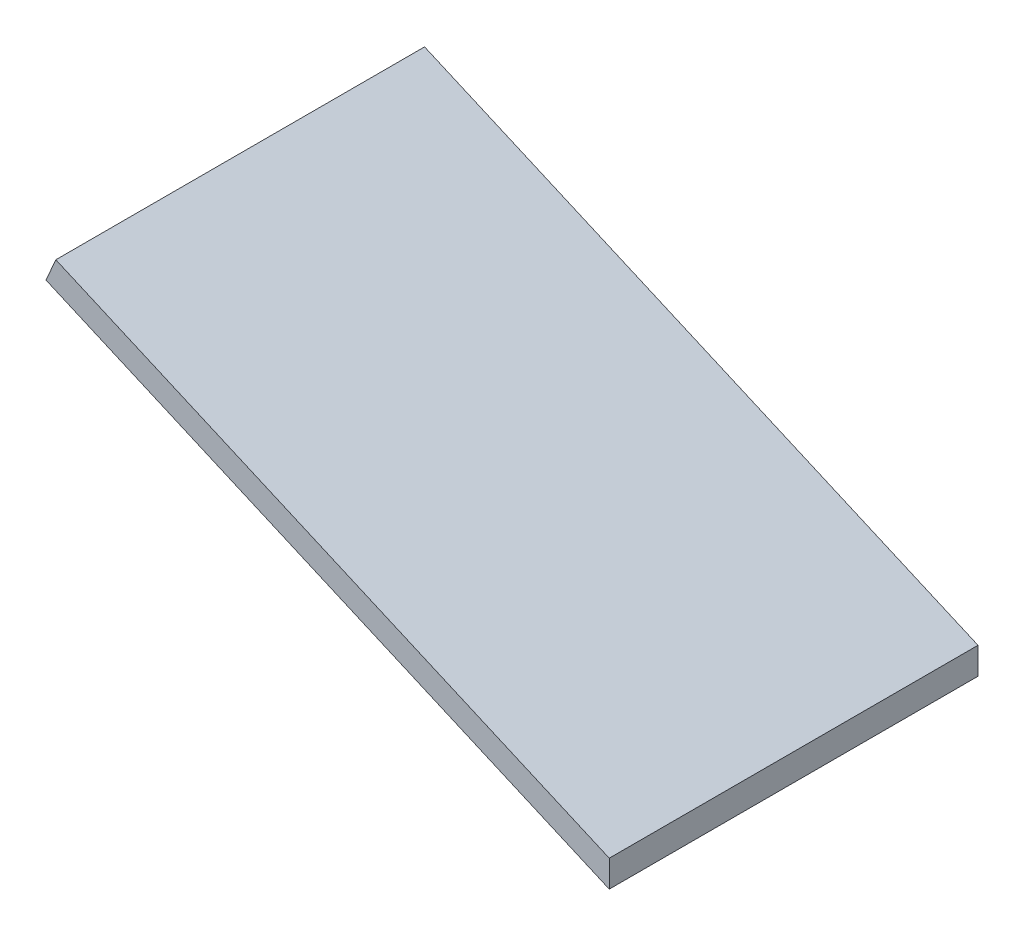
from build123d import *

# Parameters (mm, degrees)
RESSALTO_EXTRUS_O1_DEPTH = 30


with BuildPart() as part:
    # Esbo_o2 → Ressalto-extrus_o1 (new body)
    with BuildSketch(Plane.XY):
        Polygon((22.912878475, -10), (-22.912878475, 10), (-22.112878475, 11.833030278), (22.912878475, -7.817821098), align=None)
    extrude(amount=RESSALTO_EXTRUS_O1_DEPTH)


solid = part.part
